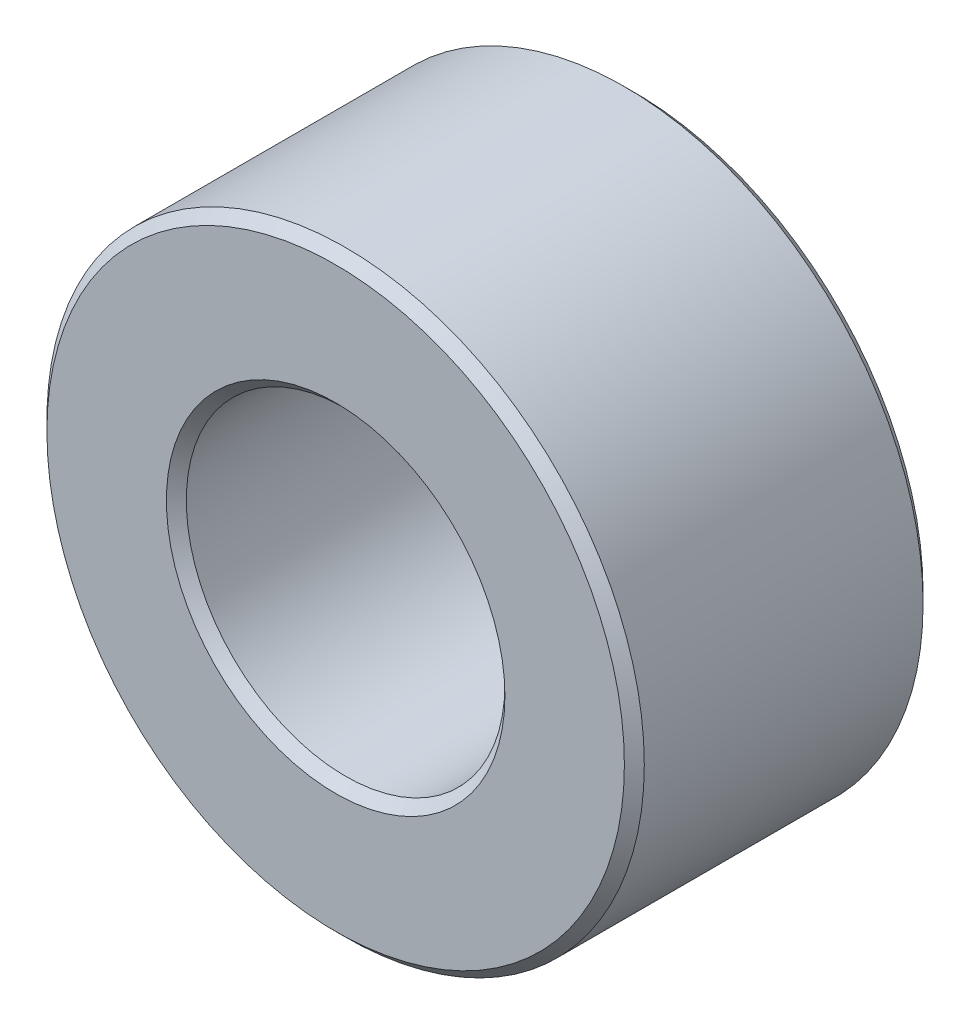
ISO-10303-21;
HEADER;
FILE_DESCRIPTION(('STEP AP214'),'2;1');
FILE_NAME('part.step','',(''),(''),'','','');
FILE_SCHEMA(('AUTOMOTIVE_DESIGN { 1 0 10303 214 1 1 1 1 }'));
ENDSEC;
DATA;
#1=APPLICATION_CONTEXT('core data for automotive mechanical design processes');
#2=APPLICATION_PROTOCOL_DEFINITION('international standard','automotive_design',2000,#1);
#3=PRODUCT_CONTEXT('',#1,'mechanical');
#4=PRODUCT('Part','Part','',(#3));
#5=PRODUCT_RELATED_PRODUCT_CATEGORY('part','',(#4));
#6=PRODUCT_DEFINITION_FORMATION('','',#4);
#7=PRODUCT_DEFINITION_CONTEXT('part definition',#1,'design');
#8=PRODUCT_DEFINITION('design','',#6,#7);
#9=PRODUCT_DEFINITION_SHAPE('','',#8);
#10=(LENGTH_UNIT() NAMED_UNIT(*) SI_UNIT(.MILLI.,.METRE.));
#11=(NAMED_UNIT(*) PLANE_ANGLE_UNIT() SI_UNIT($,.RADIAN.));
#12=(NAMED_UNIT(*) SI_UNIT($,.STERADIAN.) SOLID_ANGLE_UNIT());
#13=UNCERTAINTY_MEASURE_WITH_UNIT(LENGTH_MEASURE(1.E-05),#10,'distance_accuracy_value','');
#14=(GEOMETRIC_REPRESENTATION_CONTEXT(3) GLOBAL_UNCERTAINTY_ASSIGNED_CONTEXT((#13)) GLOBAL_UNIT_ASSIGNED_CONTEXT((#10,
#11,#12)) REPRESENTATION_CONTEXT('',''));
#15=CARTESIAN_POINT('',(0.,0.,0.));
#16=DIRECTION('',(0.,0.,1.));
#17=DIRECTION('',(1.,0.,0.));
#18=AXIS2_PLACEMENT_3D('',#15,#16,#17);
#19=CARTESIAN_POINT('',(0.,0.,1.5));
#20=DIRECTION('',(0.,0.,1.));
#21=DIRECTION('',(1.,0.,0.));
#22=AXIS2_PLACEMENT_3D('',#19,#20,#21);
#23=PLANE('',#22);
#24=CARTESIAN_POINT('',(0.,0.,1.5));
#25=DIRECTION('',(0.,0.,1.));
#26=DIRECTION('',(1.,0.,0.));
#27=AXIS2_PLACEMENT_3D('',#24,#25,#26);
#28=CIRCLE('',#27,1.7);
#29=CARTESIAN_POINT('',(1.7,0.,1.5));
#30=VERTEX_POINT('',#29);
#31=EDGE_CURVE('E10',#30,#30,#28,.F.);
#32=ORIENTED_EDGE('',*,*,#31,.T.);
#33=EDGE_LOOP('',(#32));
#34=FACE_BOUND('',#33,.T.);
#35=CARTESIAN_POINT('',(0.,0.,1.5));
#36=DIRECTION('',(0.,0.,1.));
#37=DIRECTION('',(1.,0.,0.));
#38=AXIS2_PLACEMENT_3D('',#35,#36,#37);
#39=CIRCLE('',#38,2.9);
#40=CARTESIAN_POINT('',(2.9,0.,1.5));
#41=VERTEX_POINT('',#40);
#42=EDGE_CURVE('E45',#41,#41,#39,.T.);
#43=ORIENTED_EDGE('',*,*,#42,.T.);
#44=EDGE_LOOP('',(#43));
#45=FACE_BOUND('',#44,.T.);
#46=ADVANCED_FACE('F37',(#34,#45),#23,.T.);
#47=CARTESIAN_POINT('',(0.,0.,-1.5));
#48=DIRECTION('',(0.,0.,1.));
#49=DIRECTION('',(1.,0.,0.));
#50=AXIS2_PLACEMENT_3D('',#47,#48,#49);
#51=PLANE('',#50);
#52=CARTESIAN_POINT('',(0.,0.,-1.5));
#53=DIRECTION('',(0.,0.,1.));
#54=DIRECTION('',(1.,0.,0.));
#55=AXIS2_PLACEMENT_3D('',#52,#53,#54);
#56=CIRCLE('',#55,2.9);
#57=CARTESIAN_POINT('',(2.9,0.,-1.5));
#58=VERTEX_POINT('',#57);
#59=EDGE_CURVE('E64',#58,#58,#56,.F.);
#60=ORIENTED_EDGE('',*,*,#59,.T.);
#61=EDGE_LOOP('',(#60));
#62=FACE_BOUND('',#61,.T.);
#63=CARTESIAN_POINT('',(0.,0.,-1.5));
#64=DIRECTION('',(0.,0.,1.));
#65=DIRECTION('',(1.,0.,0.));
#66=AXIS2_PLACEMENT_3D('',#63,#64,#65);
#67=CIRCLE('',#66,1.7);
#68=CARTESIAN_POINT('',(1.7,0.,-1.5));
#69=VERTEX_POINT('',#68);
#70=EDGE_CURVE('E67',#69,#69,#67,.T.);
#71=ORIENTED_EDGE('',*,*,#70,.T.);
#72=EDGE_LOOP('',(#71));
#73=FACE_BOUND('',#72,.T.);
#74=ADVANCED_FACE('F89',(#62,#73),#51,.F.);
#75=CARTESIAN_POINT('',(0.,0.,1.5));
#76=DIRECTION('',(0.,0.,-1.));
#77=DIRECTION('',(-1.,0.,0.));
#78=AXIS2_PLACEMENT_3D('',#75,#76,#77);
#79=CYLINDRICAL_SURFACE('',#78,3.);
#80=CARTESIAN_POINT('',(0.,0.,-1.4));
#81=DIRECTION('',(0.,0.,1.));
#82=DIRECTION('',(1.,0.,0.));
#83=AXIS2_PLACEMENT_3D('',#80,#81,#82);
#84=CIRCLE('',#83,3.);
#85=CARTESIAN_POINT('',(3.,0.,-1.4));
#86=VERTEX_POINT('',#85);
#87=EDGE_CURVE('E70',#86,#86,#84,.T.);
#88=ORIENTED_EDGE('',*,*,#87,.T.);
#89=EDGE_LOOP('',(#88));
#90=FACE_BOUND('',#89,.T.);
#91=CARTESIAN_POINT('',(0.,0.,1.4));
#92=DIRECTION('',(0.,0.,1.));
#93=DIRECTION('',(1.,0.,0.));
#94=AXIS2_PLACEMENT_3D('',#91,#92,#93);
#95=CIRCLE('',#94,3.);
#96=CARTESIAN_POINT('',(3.,0.,1.4));
#97=VERTEX_POINT('',#96);
#98=EDGE_CURVE('E73',#97,#97,#95,.F.);
#99=ORIENTED_EDGE('',*,*,#98,.T.);
#100=EDGE_LOOP('',(#99));
#101=FACE_BOUND('',#100,.T.);
#102=ADVANCED_FACE('F78',(#90,#101),#79,.T.);
#103=CARTESIAN_POINT('',(0.,0.,1.5));
#104=DIRECTION('',(0.,0.,-1.));
#105=DIRECTION('',(-1.,0.,0.));
#106=AXIS2_PLACEMENT_3D('',#103,#104,#105);
#107=CYLINDRICAL_SURFACE('',#106,1.6);
#108=CARTESIAN_POINT('',(0.,0.,-1.4));
#109=DIRECTION('',(0.,0.,1.));
#110=DIRECTION('',(1.,0.,0.));
#111=AXIS2_PLACEMENT_3D('',#108,#109,#110);
#112=CIRCLE('',#111,1.6);
#113=CARTESIAN_POINT('',(1.6,0.,-1.4));
#114=VERTEX_POINT('',#113);
#115=EDGE_CURVE('E52',#114,#114,#112,.F.);
#116=ORIENTED_EDGE('',*,*,#115,.T.);
#117=EDGE_LOOP('',(#116));
#118=FACE_BOUND('',#117,.T.);
#119=CARTESIAN_POINT('',(0.,0.,1.4));
#120=DIRECTION('',(0.,0.,1.));
#121=DIRECTION('',(1.,0.,0.));
#122=AXIS2_PLACEMENT_3D('',#119,#120,#121);
#123=CIRCLE('',#122,1.6);
#124=CARTESIAN_POINT('',(1.6,0.,1.4));
#125=VERTEX_POINT('',#124);
#126=EDGE_CURVE('E58',#125,#125,#123,.T.);
#127=ORIENTED_EDGE('',*,*,#126,.T.);
#128=EDGE_LOOP('',(#127));
#129=FACE_BOUND('',#128,.T.);
#130=ADVANCED_FACE('F97',(#118,#129),#107,.F.);
#131=CARTESIAN_POINT('',(0.,0.,-1.4));
#132=DIRECTION('',(0.,0.,1.));
#133=DIRECTION('',(1.,0.,0.));
#134=AXIS2_PLACEMENT_3D('',#131,#132,#133);
#135=CONICAL_SURFACE('',#134,3.,0.785398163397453);
#136=ORIENTED_EDGE('',*,*,#59,.F.);
#137=EDGE_LOOP('',(#136));
#138=FACE_BOUND('',#137,.T.);
#139=ORIENTED_EDGE('',*,*,#87,.F.);
#140=EDGE_LOOP('',(#139));
#141=FACE_BOUND('',#140,.T.);
#142=ADVANCED_FACE('F102',(#138,#141),#135,.T.);
#143=CARTESIAN_POINT('',(0.,0.,-1.5));
#144=DIRECTION('',(0.,0.,-1.));
#145=DIRECTION('',(-1.,0.,0.));
#146=AXIS2_PLACEMENT_3D('',#143,#144,#145);
#147=CONICAL_SURFACE('',#146,1.7,0.785398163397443);
#148=ORIENTED_EDGE('',*,*,#115,.F.);
#149=EDGE_LOOP('',(#148));
#150=FACE_BOUND('',#149,.T.);
#151=ORIENTED_EDGE('',*,*,#70,.F.);
#152=EDGE_LOOP('',(#151));
#153=FACE_BOUND('',#152,.T.);
#154=ADVANCED_FACE('F86',(#150,#153),#147,.F.);
#155=CARTESIAN_POINT('',(0.,0.,1.4));
#156=DIRECTION('',(0.,0.,1.));
#157=DIRECTION('',(1.,0.,0.));
#158=AXIS2_PLACEMENT_3D('',#155,#156,#157);
#159=CONICAL_SURFACE('',#158,1.6,0.785398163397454);
#160=CARTESIAN_POINT('',(1.7,0.,1.5));
#161=CARTESIAN_POINT('',(1.69895833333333,0.,1.49895833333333));
#162=CARTESIAN_POINT('',(1.69791666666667,0.,1.49791666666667));
#163=CARTESIAN_POINT('',(1.69583333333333,0.,1.49583333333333));
#164=CARTESIAN_POINT('',(1.69479166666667,0.,1.49479166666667));
#165=CARTESIAN_POINT('',(1.69270833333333,0.,1.49270833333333));
#166=CARTESIAN_POINT('',(1.69166666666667,0.,1.49166666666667));
#167=CARTESIAN_POINT('',(1.68958333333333,0.,1.48958333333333));
#168=CARTESIAN_POINT('',(1.68854166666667,0.,1.48854166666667));
#169=CARTESIAN_POINT('',(1.68645833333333,0.,1.48645833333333));
#170=CARTESIAN_POINT('',(1.68541666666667,0.,1.48541666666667));
#171=CARTESIAN_POINT('',(1.68333333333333,0.,1.48333333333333));
#172=CARTESIAN_POINT('',(1.68229166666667,0.,1.48229166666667));
#173=CARTESIAN_POINT('',(1.68020833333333,0.,1.48020833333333));
#174=CARTESIAN_POINT('',(1.67916666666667,0.,1.47916666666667));
#175=CARTESIAN_POINT('',(1.67708333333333,0.,1.47708333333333));
#176=CARTESIAN_POINT('',(1.67604166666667,0.,1.47604166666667));
#177=CARTESIAN_POINT('',(1.67395833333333,0.,1.47395833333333));
#178=CARTESIAN_POINT('',(1.67291666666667,0.,1.47291666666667));
#179=CARTESIAN_POINT('',(1.67083333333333,0.,1.47083333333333));
#180=CARTESIAN_POINT('',(1.66979166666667,0.,1.46979166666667));
#181=CARTESIAN_POINT('',(1.66770833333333,0.,1.46770833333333));
#182=CARTESIAN_POINT('',(1.66666666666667,0.,1.46666666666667));
#183=CARTESIAN_POINT('',(1.66458333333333,0.,1.46458333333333));
#184=CARTESIAN_POINT('',(1.66354166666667,0.,1.46354166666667));
#185=CARTESIAN_POINT('',(1.66145833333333,0.,1.46145833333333));
#186=CARTESIAN_POINT('',(1.66041666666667,0.,1.46041666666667));
#187=CARTESIAN_POINT('',(1.65833333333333,0.,1.45833333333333));
#188=CARTESIAN_POINT('',(1.65729166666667,0.,1.45729166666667));
#189=CARTESIAN_POINT('',(1.65520833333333,0.,1.45520833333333));
#190=CARTESIAN_POINT('',(1.65416666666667,0.,1.45416666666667));
#191=CARTESIAN_POINT('',(1.65208333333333,0.,1.45208333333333));
#192=CARTESIAN_POINT('',(1.65104166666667,0.,1.45104166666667));
#193=CARTESIAN_POINT('',(1.64895833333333,0.,1.44895833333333));
#194=CARTESIAN_POINT('',(1.64791666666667,0.,1.44791666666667));
#195=CARTESIAN_POINT('',(1.64583333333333,0.,1.44583333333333));
#196=CARTESIAN_POINT('',(1.64479166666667,0.,1.44479166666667));
#197=CARTESIAN_POINT('',(1.64270833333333,0.,1.44270833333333));
#198=CARTESIAN_POINT('',(1.64166666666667,0.,1.44166666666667));
#199=CARTESIAN_POINT('',(1.63958333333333,0.,1.43958333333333));
#200=CARTESIAN_POINT('',(1.63854166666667,0.,1.43854166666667));
#201=CARTESIAN_POINT('',(1.63645833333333,0.,1.43645833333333));
#202=CARTESIAN_POINT('',(1.63541666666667,0.,1.43541666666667));
#203=CARTESIAN_POINT('',(1.63333333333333,0.,1.43333333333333));
#204=CARTESIAN_POINT('',(1.63229166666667,0.,1.43229166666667));
#205=CARTESIAN_POINT('',(1.63020833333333,0.,1.43020833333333));
#206=CARTESIAN_POINT('',(1.62916666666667,0.,1.42916666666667));
#207=CARTESIAN_POINT('',(1.62708333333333,0.,1.42708333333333));
#208=CARTESIAN_POINT('',(1.62604166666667,0.,1.42604166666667));
#209=CARTESIAN_POINT('',(1.62395833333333,0.,1.42395833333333));
#210=CARTESIAN_POINT('',(1.62291666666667,0.,1.42291666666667));
#211=CARTESIAN_POINT('',(1.62083333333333,0.,1.42083333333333));
#212=CARTESIAN_POINT('',(1.61979166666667,0.,1.41979166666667));
#213=CARTESIAN_POINT('',(1.61770833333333,0.,1.41770833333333));
#214=CARTESIAN_POINT('',(1.61666666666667,0.,1.41666666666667));
#215=CARTESIAN_POINT('',(1.61458333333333,0.,1.41458333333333));
#216=CARTESIAN_POINT('',(1.61354166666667,0.,1.41354166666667));
#217=CARTESIAN_POINT('',(1.61145833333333,0.,1.41145833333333));
#218=CARTESIAN_POINT('',(1.61041666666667,0.,1.41041666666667));
#219=CARTESIAN_POINT('',(1.60833333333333,0.,1.40833333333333));
#220=CARTESIAN_POINT('',(1.60729166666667,0.,1.40729166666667));
#221=CARTESIAN_POINT('',(1.60520833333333,0.,1.40520833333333));
#222=CARTESIAN_POINT('',(1.60416666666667,0.,1.40416666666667));
#223=CARTESIAN_POINT('',(1.60208333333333,0.,1.40208333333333));
#224=CARTESIAN_POINT('',(1.60104166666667,0.,1.40104166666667));
#225=CARTESIAN_POINT('',(1.6,0.,1.4));
#226=B_SPLINE_CURVE_WITH_KNOTS('',3,(#160,#161,#162,#163,#164,#165,#166,#167,#168,#169,#170,
#171,#172,#173,#174,#175,#176,#177,#178,#179,#180,#181,#182,#183,#184,#185,#186,#187,#188,#189,
#190,#191,#192,#193,#194,#195,#196,#197,#198,#199,#200,#201,#202,#203,#204,#205,#206,#207,#208,
#209,#210,#211,#212,#213,#214,#215,#216,#217,#218,#219,#220,#221,#222,#223,#224,#225),
.UNSPECIFIED.,.F.,.F.,(4,2,2,2,2,2,2,2,2,2,2,2,2,2,2,2,2,2,2,2,2,2,2,2,2,2,2,2,2,2,2,2,4),(0.,
0.0044194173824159,0.00883883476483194,0.0132582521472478,0.0176776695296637,0.0220970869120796,
0.0265165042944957,0.0309359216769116,0.0353553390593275,0.0397747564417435,0.0441941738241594,
0.0486135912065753,0.0530330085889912,0.0574524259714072,0.0618718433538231,0.066291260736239,
0.0707106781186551,0.075130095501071,0.0795495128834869,0.0839689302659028,0.0883883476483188,
0.0928077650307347,0.0972271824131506,0.101646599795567,0.106066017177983,0.110485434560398,
0.114904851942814,0.11932426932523,0.123743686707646,0.128163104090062,0.132582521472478,
0.137001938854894,0.14142135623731),.UNSPECIFIED.);
#227=EDGE_CURVE('BSEAM82',#30,#125,#226,.T.);
#228=ORIENTED_EDGE('',*,*,#31,.F.);
#229=ORIENTED_EDGE('',*,*,#126,.F.);
#230=ORIENTED_EDGE('',*,*,#227,.T.);
#231=ORIENTED_EDGE('',*,*,#227,.F.);
#232=EDGE_LOOP('',(#228,#230,#229,#231));
#233=FACE_BOUND('',#232,.T.);
#234=ADVANCED_FACE('F82',(#233),#159,.F.);
#235=CARTESIAN_POINT('',(0.,0.,1.5));
#236=DIRECTION('',(0.,0.,-1.));
#237=DIRECTION('',(-1.,0.,0.));
#238=AXIS2_PLACEMENT_3D('',#235,#236,#237);
#239=CONICAL_SURFACE('',#238,2.9,0.785398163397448);
#240=ORIENTED_EDGE('',*,*,#98,.F.);
#241=EDGE_LOOP('',(#240));
#242=FACE_BOUND('',#241,.T.);
#243=ORIENTED_EDGE('',*,*,#42,.F.);
#244=EDGE_LOOP('',(#243));
#245=FACE_BOUND('',#244,.T.);
#246=ADVANCED_FACE('F39',(#242,#245),#239,.T.);
#247=CLOSED_SHELL('',(#46,#74,#102,#130,#142,#154,#234,#246));
#248=MANIFOLD_SOLID_BREP('B2',#247);
#249=ADVANCED_BREP_SHAPE_REPRESENTATION('',(#18,#248),#14);
#250=SHAPE_DEFINITION_REPRESENTATION(#9,#249);
ENDSEC;
END-ISO-10303-21;
